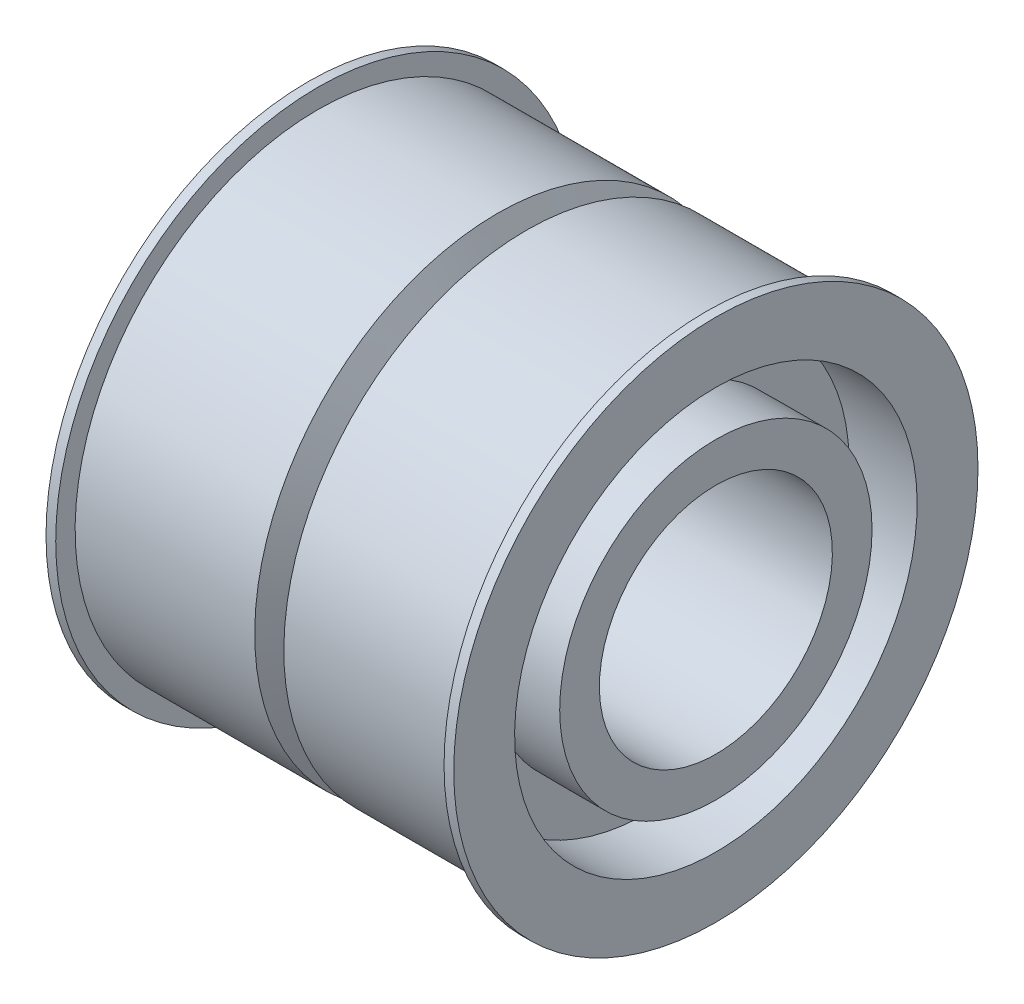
from build123d import *


with BuildPart() as part:
    # Sketch1 → Revolve1 (revolve)
    with BuildSketch(Plane.XY):
        Polygon((0, -1.953908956), (7, -1.953908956), (7, 2.706009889), (0, 2.706009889), (0, 6.9744966), (0, 8.9744966), (1, 8.9744966), (1, 6.976189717), (19.5, 6.976189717), (21, 3.976189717), (22.5, 6.976189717), (41, 6.976189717), (41, 8.9744966), (42, 8.9744966), (42, 6.9744966), (42, 2.706009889), (35, 2.706009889), (35.000017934, -1.953908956), (42, -1.938063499), (42, -6.0255034), (0, -6.0255034), align=None)
    revolve(axis=Axis((42, -18.0255034, 0), (-1, 0, 0)))


solid = part.part
